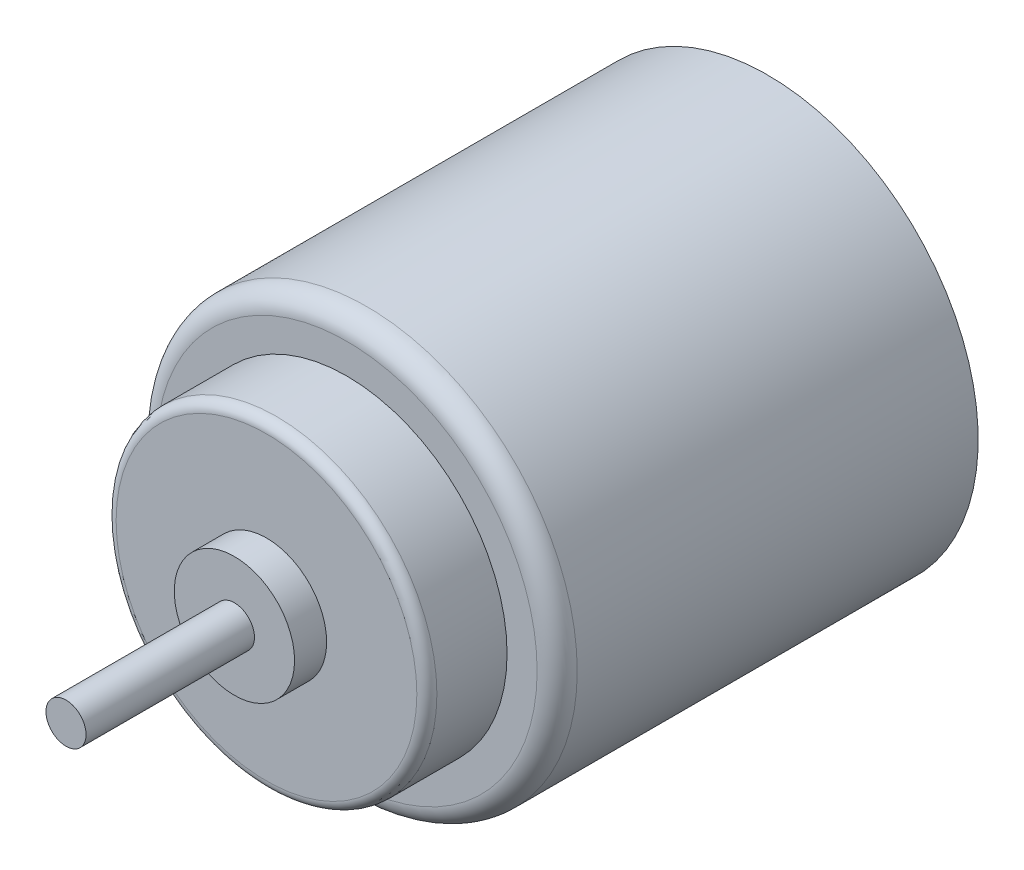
ISO-10303-21;
HEADER;
FILE_DESCRIPTION(('STEP AP214'),'2;1');
FILE_NAME('part.step','',(''),(''),'','','');
FILE_SCHEMA(('AUTOMOTIVE_DESIGN { 1 0 10303 214 1 1 1 1 }'));
ENDSEC;
DATA;
#1=APPLICATION_CONTEXT('core data for automotive mechanical design processes');
#2=APPLICATION_PROTOCOL_DEFINITION('international standard','automotive_design',2000,#1);
#3=PRODUCT_CONTEXT('',#1,'mechanical');
#4=PRODUCT('Part','Part','',(#3));
#5=PRODUCT_RELATED_PRODUCT_CATEGORY('part','',(#4));
#6=PRODUCT_DEFINITION_FORMATION('','',#4);
#7=PRODUCT_DEFINITION_CONTEXT('part definition',#1,'design');
#8=PRODUCT_DEFINITION('design','',#6,#7);
#9=PRODUCT_DEFINITION_SHAPE('','',#8);
#10=(LENGTH_UNIT() NAMED_UNIT(*) SI_UNIT(.MILLI.,.METRE.));
#11=(NAMED_UNIT(*) PLANE_ANGLE_UNIT() SI_UNIT($,.RADIAN.));
#12=(NAMED_UNIT(*) SI_UNIT($,.STERADIAN.) SOLID_ANGLE_UNIT());
#13=UNCERTAINTY_MEASURE_WITH_UNIT(LENGTH_MEASURE(1.E-05),#10,'distance_accuracy_value','');
#14=(GEOMETRIC_REPRESENTATION_CONTEXT(3) GLOBAL_UNCERTAINTY_ASSIGNED_CONTEXT((#13)) GLOBAL_UNIT_ASSIGNED_CONTEXT((#10,
#11,#12)) REPRESENTATION_CONTEXT('',''));
#15=CARTESIAN_POINT('',(0.,0.,0.));
#16=DIRECTION('',(0.,0.,1.));
#17=DIRECTION('',(1.,0.,0.));
#18=AXIS2_PLACEMENT_3D('',#15,#16,#17);
#19=CARTESIAN_POINT('',(0.,0.,21.));
#20=DIRECTION('',(0.,0.,-1.));
#21=DIRECTION('',(-1.,0.,0.));
#22=AXIS2_PLACEMENT_3D('',#19,#20,#21);
#23=CYLINDRICAL_SURFACE('',#22,10.5);
#24=CARTESIAN_POINT('',(0.,0.,20.));
#25=DIRECTION('',(0.,0.,1.));
#26=DIRECTION('',(1.,0.,0.));
#27=AXIS2_PLACEMENT_3D('',#24,#25,#26);
#28=CIRCLE('',#27,10.5);
#29=CARTESIAN_POINT('',(-10.5,0.,20.));
#30=VERTEX_POINT('',#29);
#31=EDGE_CURVE('E54',#30,#30,#28,.F.);
#32=CARTESIAN_POINT('',(0.,0.,0.));
#33=DIRECTION('',(0.,0.,1.));
#34=DIRECTION('',(1.,0.,0.));
#35=AXIS2_PLACEMENT_3D('',#32,#33,#34);
#36=CIRCLE('',#35,10.5);
#37=CARTESIAN_POINT('',(-10.5,0.,0.));
#38=VERTEX_POINT('',#37);
#39=EDGE_CURVE('E61',#38,#38,#36,.T.);
#40=CARTESIAN_POINT('',(-10.5,0.,20.));
#41=CARTESIAN_POINT('',(-10.5,0.,19.7916666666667));
#42=CARTESIAN_POINT('',(-10.5,0.,19.5833333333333));
#43=CARTESIAN_POINT('',(-10.5,0.,19.1666666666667));
#44=CARTESIAN_POINT('',(-10.5,0.,18.9583333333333));
#45=CARTESIAN_POINT('',(-10.5,0.,18.5416666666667));
#46=CARTESIAN_POINT('',(-10.5,0.,18.3333333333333));
#47=CARTESIAN_POINT('',(-10.5,0.,17.9166666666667));
#48=CARTESIAN_POINT('',(-10.5,0.,17.7083333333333));
#49=CARTESIAN_POINT('',(-10.5,0.,17.2916666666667));
#50=CARTESIAN_POINT('',(-10.5,0.,17.0833333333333));
#51=CARTESIAN_POINT('',(-10.5,0.,16.6666666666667));
#52=CARTESIAN_POINT('',(-10.5,0.,16.4583333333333));
#53=CARTESIAN_POINT('',(-10.5,0.,16.0416666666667));
#54=CARTESIAN_POINT('',(-10.5,0.,15.8333333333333));
#55=CARTESIAN_POINT('',(-10.5,0.,15.4166666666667));
#56=CARTESIAN_POINT('',(-10.5,0.,15.2083333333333));
#57=CARTESIAN_POINT('',(-10.5,0.,14.7916666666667));
#58=CARTESIAN_POINT('',(-10.5,0.,14.5833333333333));
#59=CARTESIAN_POINT('',(-10.5,0.,14.1666666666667));
#60=CARTESIAN_POINT('',(-10.5,0.,13.9583333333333));
#61=CARTESIAN_POINT('',(-10.5,0.,13.5416666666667));
#62=CARTESIAN_POINT('',(-10.5,0.,13.3333333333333));
#63=CARTESIAN_POINT('',(-10.5,0.,12.9166666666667));
#64=CARTESIAN_POINT('',(-10.5,0.,12.7083333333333));
#65=CARTESIAN_POINT('',(-10.5,0.,12.2916666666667));
#66=CARTESIAN_POINT('',(-10.5,0.,12.0833333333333));
#67=CARTESIAN_POINT('',(-10.5,0.,11.6666666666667));
#68=CARTESIAN_POINT('',(-10.5,0.,11.4583333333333));
#69=CARTESIAN_POINT('',(-10.5,0.,11.0416666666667));
#70=CARTESIAN_POINT('',(-10.5,0.,10.8333333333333));
#71=CARTESIAN_POINT('',(-10.5,0.,10.4166666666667));
#72=CARTESIAN_POINT('',(-10.5,0.,10.2083333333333));
#73=CARTESIAN_POINT('',(-10.5,0.,9.79166666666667));
#74=CARTESIAN_POINT('',(-10.5,0.,9.58333333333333));
#75=CARTESIAN_POINT('',(-10.5,0.,9.16666666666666));
#76=CARTESIAN_POINT('',(-10.5,0.,8.95833333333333));
#77=CARTESIAN_POINT('',(-10.5,0.,8.54166666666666));
#78=CARTESIAN_POINT('',(-10.5,0.,8.33333333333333));
#79=CARTESIAN_POINT('',(-10.5,0.,7.91666666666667));
#80=CARTESIAN_POINT('',(-10.5,0.,7.70833333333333));
#81=CARTESIAN_POINT('',(-10.5,0.,7.29166666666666));
#82=CARTESIAN_POINT('',(-10.5,0.,7.08333333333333));
#83=CARTESIAN_POINT('',(-10.5,0.,6.66666666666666));
#84=CARTESIAN_POINT('',(-10.5,0.,6.45833333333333));
#85=CARTESIAN_POINT('',(-10.5,0.,6.04166666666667));
#86=CARTESIAN_POINT('',(-10.5,0.,5.83333333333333));
#87=CARTESIAN_POINT('',(-10.5,0.,5.41666666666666));
#88=CARTESIAN_POINT('',(-10.5,0.,5.20833333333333));
#89=CARTESIAN_POINT('',(-10.5,0.,4.79166666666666));
#90=CARTESIAN_POINT('',(-10.5,0.,4.58333333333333));
#91=CARTESIAN_POINT('',(-10.5,0.,4.16666666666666));
#92=CARTESIAN_POINT('',(-10.5,0.,3.95833333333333));
#93=CARTESIAN_POINT('',(-10.5,0.,3.54166666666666));
#94=CARTESIAN_POINT('',(-10.5,0.,3.33333333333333));
#95=CARTESIAN_POINT('',(-10.5,0.,2.91666666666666));
#96=CARTESIAN_POINT('',(-10.5,0.,2.70833333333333));
#97=CARTESIAN_POINT('',(-10.5,0.,2.29166666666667));
#98=CARTESIAN_POINT('',(-10.5,0.,2.08333333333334));
#99=CARTESIAN_POINT('',(-10.5,0.,1.66666666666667));
#100=CARTESIAN_POINT('',(-10.5,0.,1.45833333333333));
#101=CARTESIAN_POINT('',(-10.5,0.,1.04166666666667));
#102=CARTESIAN_POINT('',(-10.5,0.,0.833333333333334));
#103=CARTESIAN_POINT('',(-10.5,0.,0.416666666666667));
#104=CARTESIAN_POINT('',(-10.5,0.,0.208333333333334));
#105=CARTESIAN_POINT('',(-10.5,0.,0.));
#106=B_SPLINE_CURVE_WITH_KNOTS('',3,(#40,#41,#42,#43,#44,#45,#46,#47,#48,#49,#50,#51,#52,#53,
#54,#55,#56,#57,#58,#59,#60,#61,#62,#63,#64,#65,#66,#67,#68,#69,#70,#71,#72,#73,#74,#75,#76,#77,
#78,#79,#80,#81,#82,#83,#84,#85,#86,#87,#88,#89,#90,#91,#92,#93,#94,#95,#96,#97,#98,#99,#100,
#101,#102,#103,#104,#105),.UNSPECIFIED.,.F.,.F.,(4,2,2,2,2,2,2,2,2,2,2,2,2,2,2,2,2,2,2,2,2,2,2,
2,2,2,2,2,2,2,2,2,4),(0.,0.625000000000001,1.25,1.875,2.5,3.125,3.75,4.375,5.,5.625,6.25,6.875,
7.5,8.125,8.75,9.375,10.,10.625,11.25,11.875,12.5,13.125,13.75,14.375,15.,15.625,16.25,16.875,
17.5,18.125,18.75,19.375,20.),.UNSPECIFIED.);
#107=EDGE_CURVE('BSEAM31',#30,#38,#106,.T.);
#108=ORIENTED_EDGE('',*,*,#31,.T.);
#109=ORIENTED_EDGE('',*,*,#39,.T.);
#110=ORIENTED_EDGE('',*,*,#107,.T.);
#111=ORIENTED_EDGE('',*,*,#107,.F.);
#112=EDGE_LOOP('',(#108,#110,#109,#111));
#113=FACE_BOUND('',#112,.T.);
#114=ADVANCED_FACE('F31',(#113),#23,.T.);
#115=CARTESIAN_POINT('',(0.,0.,21.));
#116=DIRECTION('',(0.,0.,1.));
#117=DIRECTION('',(1.,0.,0.));
#118=AXIS2_PLACEMENT_3D('',#115,#116,#117);
#119=PLANE('',#118);
#120=CARTESIAN_POINT('',(0.,0.,21.));
#121=DIRECTION('',(0.,0.,1.));
#122=DIRECTION('',(1.,0.,0.));
#123=AXIS2_PLACEMENT_3D('',#120,#121,#122);
#124=CIRCLE('',#123,9.5);
#125=CARTESIAN_POINT('',(9.5,0.,21.));
#126=VERTEX_POINT('',#125);
#127=EDGE_CURVE('E57',#126,#126,#124,.T.);
#128=ORIENTED_EDGE('',*,*,#127,.T.);
#129=EDGE_LOOP('',(#128));
#130=FACE_BOUND('',#129,.T.);
#131=CARTESIAN_POINT('',(0.,0.,21.));
#132=DIRECTION('',(0.,0.,1.));
#133=DIRECTION('',(1.,0.,0.));
#134=AXIS2_PLACEMENT_3D('',#131,#132,#133);
#135=CIRCLE('',#134,8.);
#136=CARTESIAN_POINT('',(8.,0.,21.));
#137=VERTEX_POINT('',#136);
#138=EDGE_CURVE('E64',#137,#137,#135,.T.);
#139=ORIENTED_EDGE('',*,*,#138,.F.);
#140=EDGE_LOOP('',(#139));
#141=FACE_BOUND('',#140,.T.);
#142=ADVANCED_FACE('F111',(#130,#141),#119,.T.);
#143=CARTESIAN_POINT('',(0.,0.,0.));
#144=DIRECTION('',(0.,0.,1.));
#145=DIRECTION('',(1.,0.,0.));
#146=AXIS2_PLACEMENT_3D('',#143,#144,#145);
#147=PLANE('',#146);
#148=CARTESIAN_POINT('',(0.,0.,0.));
#149=DIRECTION('',(0.,0.,-1.));
#150=DIRECTION('',(-1.,0.,0.));
#151=AXIS2_PLACEMENT_3D('',#148,#149,#150);
#152=CIRCLE('',#151,3.);
#153=CARTESIAN_POINT('',(-3.,0.,0.));
#154=VERTEX_POINT('',#153);
#155=EDGE_CURVE('E42',#154,#154,#152,.T.);
#156=ORIENTED_EDGE('',*,*,#155,.F.);
#157=EDGE_LOOP('',(#156));
#158=FACE_BOUND('',#157,.T.);
#159=ORIENTED_EDGE('',*,*,#39,.F.);
#160=EDGE_LOOP('',(#159));
#161=FACE_BOUND('',#160,.T.);
#162=ADVANCED_FACE('F107',(#158,#161),#147,.F.);
#163=CARTESIAN_POINT('',(0.,0.,25.));
#164=DIRECTION('',(0.,0.,-1.));
#165=DIRECTION('',(-1.,0.,0.));
#166=AXIS2_PLACEMENT_3D('',#163,#164,#165);
#167=CYLINDRICAL_SURFACE('',#166,8.);
#168=CARTESIAN_POINT('',(0.,0.,24.5));
#169=DIRECTION('',(0.,0.,1.));
#170=DIRECTION('',(1.,0.,0.));
#171=AXIS2_PLACEMENT_3D('',#168,#169,#170);
#172=CIRCLE('',#171,8.);
#173=CARTESIAN_POINT('',(8.,0.,24.5));
#174=VERTEX_POINT('',#173);
#175=EDGE_CURVE('E46',#174,#174,#172,.F.);
#176=ORIENTED_EDGE('',*,*,#175,.T.);
#177=EDGE_LOOP('',(#176));
#178=FACE_BOUND('',#177,.T.);
#179=ORIENTED_EDGE('',*,*,#138,.T.);
#180=EDGE_LOOP('',(#179));
#181=FACE_BOUND('',#180,.T.);
#182=ADVANCED_FACE('F101',(#178,#181),#167,.T.);
#183=CARTESIAN_POINT('',(0.,0.,25.));
#184=DIRECTION('',(0.,0.,1.));
#185=DIRECTION('',(1.,0.,0.));
#186=AXIS2_PLACEMENT_3D('',#183,#184,#185);
#187=PLANE('',#186);
#188=CARTESIAN_POINT('',(0.,0.,25.));
#189=DIRECTION('',(0.,0.,1.));
#190=DIRECTION('',(1.,0.,0.));
#191=AXIS2_PLACEMENT_3D('',#188,#189,#190);
#192=CIRCLE('',#191,7.5);
#193=CARTESIAN_POINT('',(7.5,0.,25.));
#194=VERTEX_POINT('',#193);
#195=EDGE_CURVE('E51',#194,#194,#192,.T.);
#196=ORIENTED_EDGE('',*,*,#195,.T.);
#197=EDGE_LOOP('',(#196));
#198=FACE_BOUND('',#197,.T.);
#199=CARTESIAN_POINT('',(0.,0.,25.));
#200=DIRECTION('',(0.,0.,1.));
#201=DIRECTION('',(1.,0.,0.));
#202=AXIS2_PLACEMENT_3D('',#199,#200,#201);
#203=CIRCLE('',#202,3.);
#204=CARTESIAN_POINT('',(3.,0.,25.));
#205=VERTEX_POINT('',#204);
#206=EDGE_CURVE('E68',#205,#205,#203,.T.);
#207=ORIENTED_EDGE('',*,*,#206,.F.);
#208=EDGE_LOOP('',(#207));
#209=FACE_BOUND('',#208,.T.);
#210=ADVANCED_FACE('F96',(#198,#209),#187,.T.);
#211=CARTESIAN_POINT('',(0.,0.,26.6));
#212=DIRECTION('',(0.,0.,-1.));
#213=DIRECTION('',(-1.,0.,0.));
#214=AXIS2_PLACEMENT_3D('',#211,#212,#213);
#215=CYLINDRICAL_SURFACE('',#214,3.);
#216=CARTESIAN_POINT('',(0.,0.,26.6));
#217=DIRECTION('',(0.,0.,1.));
#218=DIRECTION('',(1.,0.,0.));
#219=AXIS2_PLACEMENT_3D('',#216,#217,#218);
#220=CIRCLE('',#219,3.);
#221=CARTESIAN_POINT('',(3.,0.,26.6));
#222=VERTEX_POINT('',#221);
#223=EDGE_CURVE('E65',#222,#222,#220,.T.);
#224=ORIENTED_EDGE('',*,*,#223,.F.);
#225=EDGE_LOOP('',(#224));
#226=FACE_BOUND('',#225,.T.);
#227=ORIENTED_EDGE('',*,*,#206,.T.);
#228=EDGE_LOOP('',(#227));
#229=FACE_BOUND('',#228,.T.);
#230=ADVANCED_FACE('F90',(#226,#229),#215,.T.);
#231=CARTESIAN_POINT('',(0.,0.,26.6));
#232=DIRECTION('',(0.,0.,1.));
#233=DIRECTION('',(1.,0.,0.));
#234=AXIS2_PLACEMENT_3D('',#231,#232,#233);
#235=PLANE('',#234);
#236=CARTESIAN_POINT('',(0.,0.,26.6));
#237=DIRECTION('',(0.,0.,1.));
#238=DIRECTION('',(1.,0.,0.));
#239=AXIS2_PLACEMENT_3D('',#236,#237,#238);
#240=CIRCLE('',#239,1.);
#241=CARTESIAN_POINT('',(1.,0.,26.6));
#242=VERTEX_POINT('',#241);
#243=EDGE_CURVE('E60',#242,#242,#240,.T.);
#244=ORIENTED_EDGE('',*,*,#243,.F.);
#245=EDGE_LOOP('',(#244));
#246=FACE_BOUND('',#245,.T.);
#247=ORIENTED_EDGE('',*,*,#223,.T.);
#248=EDGE_LOOP('',(#247));
#249=FACE_BOUND('',#248,.T.);
#250=ADVANCED_FACE('F84',(#246,#249),#235,.T.);
#251=CARTESIAN_POINT('',(0.,0.,35.));
#252=DIRECTION('',(0.,0.,-1.));
#253=DIRECTION('',(-1.,0.,0.));
#254=AXIS2_PLACEMENT_3D('',#251,#252,#253);
#255=CYLINDRICAL_SURFACE('',#254,1.);
#256=CARTESIAN_POINT('',(0.,0.,35.));
#257=DIRECTION('',(0.,0.,1.));
#258=DIRECTION('',(1.,0.,0.));
#259=AXIS2_PLACEMENT_3D('',#256,#257,#258);
#260=CIRCLE('',#259,1.);
#261=CARTESIAN_POINT('',(1.,0.,35.));
#262=VERTEX_POINT('',#261);
#263=EDGE_CURVE('E73',#262,#262,#260,.T.);
#264=ORIENTED_EDGE('',*,*,#263,.F.);
#265=EDGE_LOOP('',(#264));
#266=FACE_BOUND('',#265,.T.);
#267=ORIENTED_EDGE('',*,*,#243,.T.);
#268=EDGE_LOOP('',(#267));
#269=FACE_BOUND('',#268,.T.);
#270=ADVANCED_FACE('F81',(#266,#269),#255,.T.);
#271=CARTESIAN_POINT('',(0.,0.,35.));
#272=DIRECTION('',(0.,0.,1.));
#273=DIRECTION('',(1.,0.,0.));
#274=AXIS2_PLACEMENT_3D('',#271,#272,#273);
#275=PLANE('',#274);
#276=ORIENTED_EDGE('',*,*,#263,.T.);
#277=EDGE_LOOP('',(#276));
#278=FACE_BOUND('',#277,.T.);
#279=ADVANCED_FACE('F79',(#278),#275,.T.);
#280=CARTESIAN_POINT('',(0.,0.,20.));
#281=DIRECTION('',(0.,0.,1.));
#282=DIRECTION('',(1.,0.,0.));
#283=AXIS2_PLACEMENT_3D('',#280,#281,#282);
#284=TOROIDAL_SURFACE('',#283,9.5,1.);
#285=ORIENTED_EDGE('',*,*,#31,.F.);
#286=EDGE_LOOP('',(#285));
#287=FACE_BOUND('',#286,.T.);
#288=ORIENTED_EDGE('',*,*,#127,.F.);
#289=EDGE_LOOP('',(#288));
#290=FACE_BOUND('',#289,.T.);
#291=ADVANCED_FACE('F122',(#287,#290),#284,.T.);
#292=CARTESIAN_POINT('',(0.,0.,24.5));
#293=DIRECTION('',(0.,0.,1.));
#294=DIRECTION('',(1.,0.,0.));
#295=AXIS2_PLACEMENT_3D('',#292,#293,#294);
#296=TOROIDAL_SURFACE('',#295,7.5,0.5);
#297=ORIENTED_EDGE('',*,*,#175,.F.);
#298=EDGE_LOOP('',(#297));
#299=FACE_BOUND('',#298,.T.);
#300=ORIENTED_EDGE('',*,*,#195,.F.);
#301=EDGE_LOOP('',(#300));
#302=FACE_BOUND('',#301,.T.);
#303=ADVANCED_FACE('F124',(#299,#302),#296,.T.);
#304=CARTESIAN_POINT('',(0.,0.,-2.));
#305=DIRECTION('',(0.,0.,1.));
#306=DIRECTION('',(1.,0.,0.));
#307=AXIS2_PLACEMENT_3D('',#304,#305,#306);
#308=CYLINDRICAL_SURFACE('',#307,3.);
#309=CARTESIAN_POINT('',(0.,0.,-1.5));
#310=DIRECTION('',(0.,0.,-1.));
#311=DIRECTION('',(-1.,0.,0.));
#312=AXIS2_PLACEMENT_3D('',#309,#310,#311);
#313=CIRCLE('',#312,3.);
#314=CARTESIAN_POINT('',(-3.,0.,-1.5));
#315=VERTEX_POINT('',#314);
#316=EDGE_CURVE('E10',#315,#315,#313,.F.);
#317=ORIENTED_EDGE('',*,*,#316,.T.);
#318=EDGE_LOOP('',(#317));
#319=FACE_BOUND('',#318,.T.);
#320=ORIENTED_EDGE('',*,*,#155,.T.);
#321=EDGE_LOOP('',(#320));
#322=FACE_BOUND('',#321,.T.);
#323=ADVANCED_FACE('F127',(#319,#322),#308,.T.);
#324=CARTESIAN_POINT('',(0.,0.,-2.));
#325=DIRECTION('',(0.,0.,-1.));
#326=DIRECTION('',(-1.,0.,0.));
#327=AXIS2_PLACEMENT_3D('',#324,#325,#326);
#328=PLANE('',#327);
#329=CARTESIAN_POINT('',(0.,0.,-2.));
#330=DIRECTION('',(0.,0.,-1.));
#331=DIRECTION('',(-1.,0.,0.));
#332=AXIS2_PLACEMENT_3D('',#329,#330,#331);
#333=CIRCLE('',#332,2.5);
#334=CARTESIAN_POINT('',(-2.5,0.,-2.));
#335=VERTEX_POINT('',#334);
#336=EDGE_CURVE('E38',#335,#335,#333,.T.);
#337=ORIENTED_EDGE('',*,*,#336,.T.);
#338=EDGE_LOOP('',(#337));
#339=FACE_BOUND('',#338,.T.);
#340=ADVANCED_FACE('F132',(#339),#328,.T.);
#341=CARTESIAN_POINT('',(0.,0.,-1.5));
#342=DIRECTION('',(0.,0.,-1.));
#343=DIRECTION('',(-1.,0.,0.));
#344=AXIS2_PLACEMENT_3D('',#341,#342,#343);
#345=TOROIDAL_SURFACE('',#344,2.5,0.5);
#346=ORIENTED_EDGE('',*,*,#316,.F.);
#347=EDGE_LOOP('',(#346));
#348=FACE_BOUND('',#347,.T.);
#349=ORIENTED_EDGE('',*,*,#336,.F.);
#350=EDGE_LOOP('',(#349));
#351=FACE_BOUND('',#350,.T.);
#352=ADVANCED_FACE('F33',(#348,#351),#345,.T.);
#353=CLOSED_SHELL('',(#114,#142,#162,#182,#210,#230,#250,#270,#279,#291,#303,#323,#340,#352));
#354=MANIFOLD_SOLID_BREP('B2',#353);
#355=ADVANCED_BREP_SHAPE_REPRESENTATION('',(#18,#354),#14);
#356=SHAPE_DEFINITION_REPRESENTATION(#9,#355);
ENDSEC;
END-ISO-10303-21;
